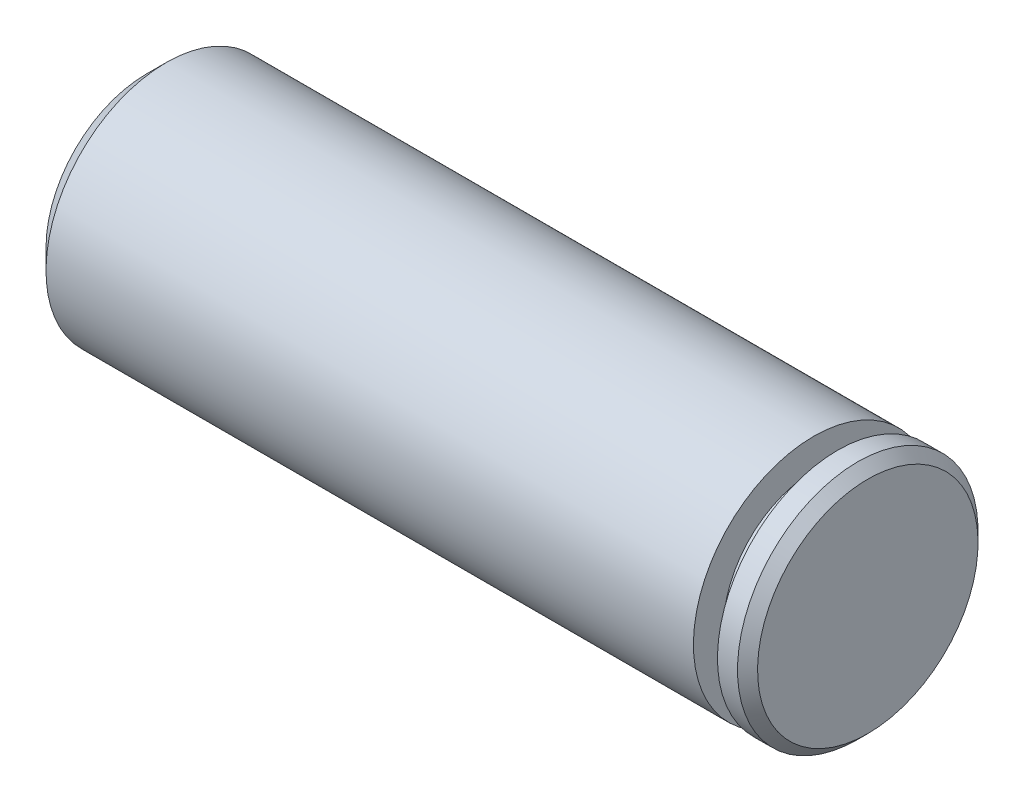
ISO-10303-21;
HEADER;
FILE_DESCRIPTION(('STEP AP214'),'2;1');
FILE_NAME('part.step','',(''),(''),'','','');
FILE_SCHEMA(('AUTOMOTIVE_DESIGN { 1 0 10303 214 1 1 1 1 }'));
ENDSEC;
DATA;
#1=APPLICATION_CONTEXT('core data for automotive mechanical design processes');
#2=APPLICATION_PROTOCOL_DEFINITION('international standard','automotive_design',2000,#1);
#3=PRODUCT_CONTEXT('',#1,'mechanical');
#4=PRODUCT('Part','Part','',(#3));
#5=PRODUCT_RELATED_PRODUCT_CATEGORY('part','',(#4));
#6=PRODUCT_DEFINITION_FORMATION('','',#4);
#7=PRODUCT_DEFINITION_CONTEXT('part definition',#1,'design');
#8=PRODUCT_DEFINITION('design','',#6,#7);
#9=PRODUCT_DEFINITION_SHAPE('','',#8);
#10=(LENGTH_UNIT() NAMED_UNIT(*) SI_UNIT(.MILLI.,.METRE.));
#11=(NAMED_UNIT(*) PLANE_ANGLE_UNIT() SI_UNIT($,.RADIAN.));
#12=(NAMED_UNIT(*) SI_UNIT($,.STERADIAN.) SOLID_ANGLE_UNIT());
#13=UNCERTAINTY_MEASURE_WITH_UNIT(LENGTH_MEASURE(1.E-05),#10,'distance_accuracy_value','');
#14=(GEOMETRIC_REPRESENTATION_CONTEXT(3) GLOBAL_UNCERTAINTY_ASSIGNED_CONTEXT((#13)) GLOBAL_UNIT_ASSIGNED_CONTEXT((#10,
#11,#12)) REPRESENTATION_CONTEXT('',''));
#15=CARTESIAN_POINT('',(0.,0.,0.));
#16=DIRECTION('',(0.,0.,1.));
#17=DIRECTION('',(1.,0.,0.));
#18=AXIS2_PLACEMENT_3D('',#15,#16,#17);
#19=CARTESIAN_POINT('',(0.,3.,0.));
#20=DIRECTION('',(1.,0.,0.));
#21=DIRECTION('',(0.,0.,-1.));
#22=AXIS2_PLACEMENT_3D('',#19,#20,#21);
#23=PLANE('',#22);
#24=CARTESIAN_POINT('',(-5.6841684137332E-11,0.,0.));
#25=DIRECTION('',(-1.,0.,0.));
#26=DIRECTION('',(0.,-1.,0.));
#27=AXIS2_PLACEMENT_3D('',#24,#25,#26);
#28=CIRCLE('',#27,5.50000000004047);
#29=CARTESIAN_POINT('',(-5.68399945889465E-11,-5.50000000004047,0.));
#30=VERTEX_POINT('',#29);
#31=EDGE_CURVE('E18',#30,#30,#28,.T.);
#32=ORIENTED_EDGE('',*,*,#31,.F.);
#33=EDGE_LOOP('',(#32));
#34=FACE_BOUND('',#33,.T.);
#35=ADVANCED_FACE('F14',(#34),#23,.T.);
#36=CARTESIAN_POINT('',(-0.499999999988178,0.,0.));
#37=DIRECTION('',(-1.,0.,0.));
#38=DIRECTION('',(0.,-1.,0.));
#39=AXIS2_PLACEMENT_3D('',#36,#37,#38);
#40=CONICAL_SURFACE('',#39,5.99999999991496,0.785398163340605);
#41=CARTESIAN_POINT('',(-0.499999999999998,0.,0.));
#42=DIRECTION('',(1.,0.,0.));
#43=DIRECTION('',(0.,1.,0.));
#44=AXIS2_PLACEMENT_3D('',#41,#42,#43);
#45=CIRCLE('',#44,6.);
#46=CARTESIAN_POINT('',(-0.5,6.,0.));
#47=VERTEX_POINT('',#46);
#48=EDGE_CURVE('E30',#47,#47,#45,.F.);
#49=ORIENTED_EDGE('',*,*,#48,.F.);
#50=EDGE_LOOP('',(#49));
#51=FACE_BOUND('',#50,.T.);
#52=ORIENTED_EDGE('',*,*,#31,.T.);
#53=EDGE_LOOP('',(#52));
#54=FACE_BOUND('',#53,.T.);
#55=ADVANCED_FACE('F48',(#51,#54),#40,.T.);
#56=CARTESIAN_POINT('',(-0.749999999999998,0.,0.));
#57=DIRECTION('',(1.,0.,0.));
#58=DIRECTION('',(0.,1.,0.));
#59=AXIS2_PLACEMENT_3D('',#56,#57,#58);
#60=CYLINDRICAL_SURFACE('',#59,6.);
#61=ORIENTED_EDGE('',*,*,#48,.T.);
#62=EDGE_LOOP('',(#61));
#63=FACE_BOUND('',#62,.T.);
#64=CARTESIAN_POINT('',(-1.5,0.,0.));
#65=DIRECTION('',(1.,0.,0.));
#66=DIRECTION('',(0.,1.,0.));
#67=AXIS2_PLACEMENT_3D('',#64,#65,#66);
#68=CIRCLE('',#67,6.);
#69=CARTESIAN_POINT('',(-1.5,6.,0.));
#70=VERTEX_POINT('',#69);
#71=EDGE_CURVE('E32',#70,#70,#68,.F.);
#72=ORIENTED_EDGE('',*,*,#71,.F.);
#73=EDGE_LOOP('',(#72));
#74=FACE_BOUND('',#73,.T.);
#75=ADVANCED_FACE('F46',(#63,#74),#60,.T.);
#76=CARTESIAN_POINT('',(-1.5,5.25,0.));
#77=DIRECTION('',(-1.,0.,0.));
#78=DIRECTION('',(0.,-1.,0.));
#79=AXIS2_PLACEMENT_3D('',#76,#77,#78);
#80=PLANE('',#79);
#81=CARTESIAN_POINT('',(-1.5,0.,0.));
#82=DIRECTION('',(1.,0.,0.));
#83=DIRECTION('',(0.,1.,0.));
#84=AXIS2_PLACEMENT_3D('',#81,#82,#83);
#85=CIRCLE('',#84,4.5);
#86=CARTESIAN_POINT('',(-1.5,4.5,0.));
#87=VERTEX_POINT('',#86);
#88=EDGE_CURVE('E39',#87,#87,#85,.F.);
#89=ORIENTED_EDGE('',*,*,#88,.F.);
#90=EDGE_LOOP('',(#89));
#91=FACE_BOUND('',#90,.T.);
#92=ORIENTED_EDGE('',*,*,#71,.T.);
#93=EDGE_LOOP('',(#92));
#94=FACE_BOUND('',#93,.T.);
#95=ADVANCED_FACE('F44',(#91,#94),#80,.T.);
#96=CARTESIAN_POINT('',(-2.1,0.,0.));
#97=DIRECTION('',(1.,0.,0.));
#98=DIRECTION('',(0.,1.,0.));
#99=AXIS2_PLACEMENT_3D('',#96,#97,#98);
#100=CYLINDRICAL_SURFACE('',#99,4.5);
#101=ORIENTED_EDGE('',*,*,#88,.T.);
#102=EDGE_LOOP('',(#101));
#103=FACE_BOUND('',#102,.T.);
#104=CARTESIAN_POINT('',(-2.7,0.,0.));
#105=DIRECTION('',(1.,0.,0.));
#106=DIRECTION('',(0.,1.,0.));
#107=AXIS2_PLACEMENT_3D('',#104,#105,#106);
#108=CIRCLE('',#107,4.5);
#109=CARTESIAN_POINT('',(-2.7,4.5,0.));
#110=VERTEX_POINT('',#109);
#111=EDGE_CURVE('E36',#110,#110,#108,.F.);
#112=ORIENTED_EDGE('',*,*,#111,.F.);
#113=EDGE_LOOP('',(#112));
#114=FACE_BOUND('',#113,.T.);
#115=ADVANCED_FACE('F56',(#103,#114),#100,.T.);
#116=CARTESIAN_POINT('',(-36.,2.99999999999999,0.));
#117=DIRECTION('',(-1.,0.,0.));
#118=DIRECTION('',(0.,-1.,0.));
#119=AXIS2_PLACEMENT_3D('',#116,#117,#118);
#120=PLANE('',#119);
#121=CARTESIAN_POINT('',(-36.000000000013,0.,0.));
#122=DIRECTION('',(1.,0.,0.));
#123=DIRECTION('',(0.,1.,0.));
#124=AXIS2_PLACEMENT_3D('',#121,#122,#123);
#125=CIRCLE('',#124,4.99999999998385);
#126=CARTESIAN_POINT('',(-36.000000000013,4.99999999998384,0.));
#127=VERTEX_POINT('',#126);
#128=EDGE_CURVE('E27',#127,#127,#125,.T.);
#129=ORIENTED_EDGE('',*,*,#128,.F.);
#130=EDGE_LOOP('',(#129));
#131=FACE_BOUND('',#130,.T.);
#132=ADVANCED_FACE('F73',(#131),#120,.T.);
#133=CARTESIAN_POINT('',(-2.7,5.25,0.));
#134=DIRECTION('',(1.,0.,0.));
#135=DIRECTION('',(0.,0.,-1.));
#136=AXIS2_PLACEMENT_3D('',#133,#134,#135);
#137=PLANE('',#136);
#138=CARTESIAN_POINT('',(-2.7,0.,0.));
#139=DIRECTION('',(1.,0.,0.));
#140=DIRECTION('',(0.,1.,0.));
#141=AXIS2_PLACEMENT_3D('',#138,#139,#140);
#142=CIRCLE('',#141,6.);
#143=CARTESIAN_POINT('',(-2.7,6.,0.));
#144=VERTEX_POINT('',#143);
#145=EDGE_CURVE('E22',#144,#144,#142,.F.);
#146=ORIENTED_EDGE('',*,*,#145,.F.);
#147=EDGE_LOOP('',(#146));
#148=FACE_BOUND('',#147,.T.);
#149=ORIENTED_EDGE('',*,*,#111,.T.);
#150=EDGE_LOOP('',(#149));
#151=FACE_BOUND('',#150,.T.);
#152=ADVANCED_FACE('F67',(#148,#151),#137,.T.);
#153=CARTESIAN_POINT('',(-34.9999999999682,0.,0.));
#154=DIRECTION('',(1.,0.,0.));
#155=DIRECTION('',(0.,1.,0.));
#156=AXIS2_PLACEMENT_3D('',#153,#154,#155);
#157=CONICAL_SURFACE('',#156,6.00000000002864,0.785398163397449);
#158=CARTESIAN_POINT('',(-35.,0.,0.));
#159=DIRECTION('',(1.,0.,0.));
#160=DIRECTION('',(0.,1.,0.));
#161=AXIS2_PLACEMENT_3D('',#158,#159,#160);
#162=CIRCLE('',#161,6.);
#163=CARTESIAN_POINT('',(-35.,5.99999999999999,0.));
#164=VERTEX_POINT('',#163);
#165=EDGE_CURVE('E9',#164,#164,#162,.T.);
#166=ORIENTED_EDGE('',*,*,#165,.F.);
#167=EDGE_LOOP('',(#166));
#168=FACE_BOUND('',#167,.T.);
#169=ORIENTED_EDGE('',*,*,#128,.T.);
#170=EDGE_LOOP('',(#169));
#171=FACE_BOUND('',#170,.T.);
#172=ADVANCED_FACE('F62',(#168,#171),#157,.T.);
#173=CARTESIAN_POINT('',(-19.35,0.,0.));
#174=DIRECTION('',(1.,0.,0.));
#175=DIRECTION('',(0.,1.,0.));
#176=AXIS2_PLACEMENT_3D('',#173,#174,#175);
#177=CYLINDRICAL_SURFACE('',#176,6.);
#178=ORIENTED_EDGE('',*,*,#145,.T.);
#179=EDGE_LOOP('',(#178));
#180=FACE_BOUND('',#179,.T.);
#181=ORIENTED_EDGE('',*,*,#165,.T.);
#182=EDGE_LOOP('',(#181));
#183=FACE_BOUND('',#182,.T.);
#184=ADVANCED_FACE('F16',(#180,#183),#177,.T.);
#185=CLOSED_SHELL('',(#35,#55,#75,#95,#115,#132,#152,#172,#184));
#186=MANIFOLD_SOLID_BREP('B1',#185);
#187=ADVANCED_BREP_SHAPE_REPRESENTATION('',(#18,#186),#14);
#188=SHAPE_DEFINITION_REPRESENTATION(#9,#187);
ENDSEC;
END-ISO-10303-21;
